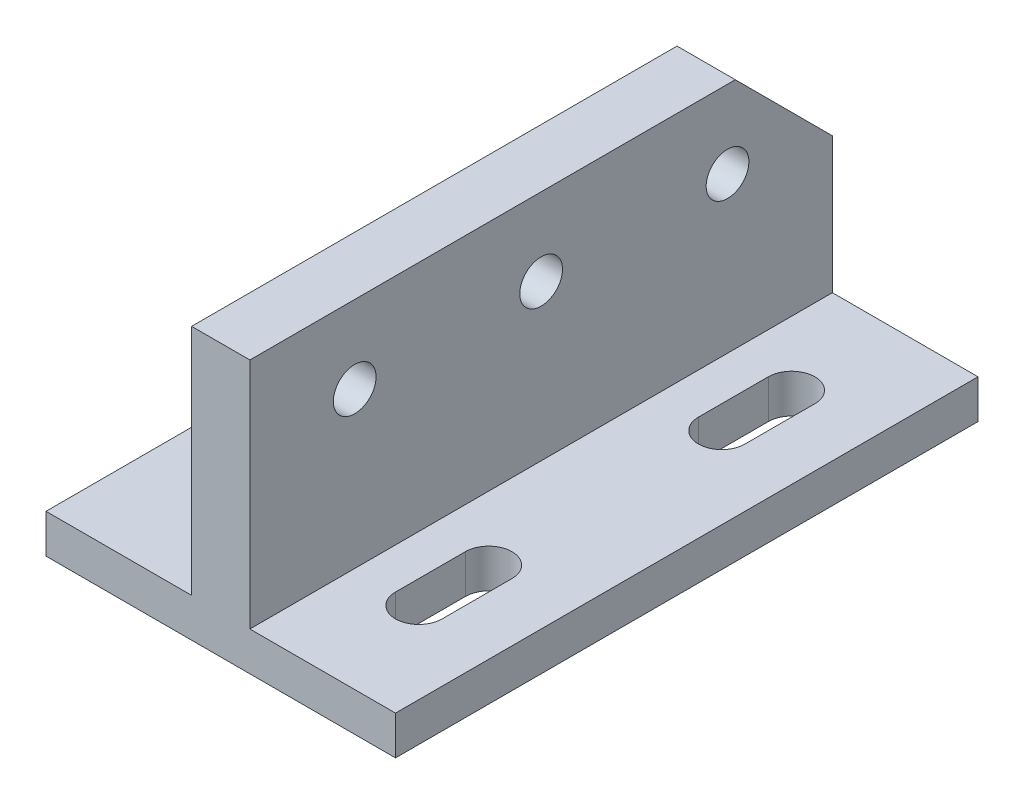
ISO-10303-21;
HEADER;
FILE_DESCRIPTION(('STEP AP214'),'2;1');
FILE_NAME('part.step','',(''),(''),'','','');
FILE_SCHEMA(('AUTOMOTIVE_DESIGN { 1 0 10303 214 1 1 1 1 }'));
ENDSEC;
DATA;
#1=APPLICATION_CONTEXT('core data for automotive mechanical design processes');
#2=APPLICATION_PROTOCOL_DEFINITION('international standard','automotive_design',2000,#1);
#3=PRODUCT_CONTEXT('',#1,'mechanical');
#4=PRODUCT('Part','Part','',(#3));
#5=PRODUCT_RELATED_PRODUCT_CATEGORY('part','',(#4));
#6=PRODUCT_DEFINITION_FORMATION('','',#4);
#7=PRODUCT_DEFINITION_CONTEXT('part definition',#1,'design');
#8=PRODUCT_DEFINITION('design','',#6,#7);
#9=PRODUCT_DEFINITION_SHAPE('','',#8);
#10=(LENGTH_UNIT() NAMED_UNIT(*) SI_UNIT(.MILLI.,.METRE.));
#11=(NAMED_UNIT(*) PLANE_ANGLE_UNIT() SI_UNIT($,.RADIAN.));
#12=(NAMED_UNIT(*) SI_UNIT($,.STERADIAN.) SOLID_ANGLE_UNIT());
#13=UNCERTAINTY_MEASURE_WITH_UNIT(LENGTH_MEASURE(1.E-05),#10,'distance_accuracy_value','');
#14=(GEOMETRIC_REPRESENTATION_CONTEXT(3) GLOBAL_UNCERTAINTY_ASSIGNED_CONTEXT((#13)) GLOBAL_UNIT_ASSIGNED_CONTEXT((#10,
#11,#12)) REPRESENTATION_CONTEXT('',''));
#15=CARTESIAN_POINT('',(0.,0.,0.));
#16=DIRECTION('',(0.,0.,1.));
#17=DIRECTION('',(1.,0.,0.));
#18=AXIS2_PLACEMENT_3D('',#15,#16,#17);
#19=CARTESIAN_POINT('',(-22.5,0.,-75.));
#20=DIRECTION('',(-1.,0.,0.));
#21=DIRECTION('',(0.,0.,1.));
#22=AXIS2_PLACEMENT_3D('',#19,#20,#21);
#23=PLANE('',#22);
#24=DIRECTION('',(0.,-1.,0.));
#25=VECTOR('',#24,1.);
#26=CARTESIAN_POINT('',(-22.5,0.,0.));
#27=LINE('',#26,#25);
#28=CARTESIAN_POINT('',(-22.5,5.,0.));
#29=VERTEX_POINT('',#28);
#30=CARTESIAN_POINT('',(-22.5,0.,0.));
#31=VERTEX_POINT('',#30);
#32=EDGE_CURVE('E362',#29,#31,#27,.T.);
#33=ORIENTED_EDGE('',*,*,#32,.F.);
#34=DIRECTION('',(0.,0.,1.));
#35=VECTOR('',#34,1.);
#36=CARTESIAN_POINT('',(-22.5,5.,-75.));
#37=LINE('',#36,#35);
#38=CARTESIAN_POINT('',(-22.5,5.,-75.));
#39=VERTEX_POINT('',#38);
#40=EDGE_CURVE('E338',#39,#29,#37,.T.);
#41=ORIENTED_EDGE('',*,*,#40,.F.);
#42=DIRECTION('',(0.,-1.,0.));
#43=VECTOR('',#42,1.);
#44=CARTESIAN_POINT('',(-22.5,0.,-75.));
#45=LINE('',#44,#43);
#46=CARTESIAN_POINT('',(-22.5,0.,-75.));
#47=VERTEX_POINT('',#46);
#48=EDGE_CURVE('E335',#39,#47,#45,.T.);
#49=ORIENTED_EDGE('',*,*,#48,.T.);
#50=DIRECTION('',(0.,0.,1.));
#51=VECTOR('',#50,1.);
#52=CARTESIAN_POINT('',(-22.5,0.,-75.));
#53=LINE('',#52,#51);
#54=EDGE_CURVE('E361',#47,#31,#53,.T.);
#55=ORIENTED_EDGE('',*,*,#54,.T.);
#56=EDGE_LOOP('',(#33,#41,#49,#55));
#57=FACE_BOUND('',#56,.T.);
#58=ADVANCED_FACE('F37',(#57),#23,.T.);
#59=CARTESIAN_POINT('',(-22.5,5.,-75.));
#60=DIRECTION('',(0.,1.,0.));
#61=DIRECTION('',(-1.,0.,0.));
#62=AXIS2_PLACEMENT_3D('',#59,#60,#61);
#63=PLANE('',#62);
#64=CARTESIAN_POINT('',(-12.,5.,-52.5));
#65=DIRECTION('',(0.,1.,0.));
#66=DIRECTION('',(-1.,0.,0.));
#67=AXIS2_PLACEMENT_3D('',#64,#65,#66);
#68=CIRCLE('',#67,3.);
#69=CARTESIAN_POINT('',(-15.,5.,-52.5));
#70=VERTEX_POINT('',#69);
#71=CARTESIAN_POINT('',(-8.99999999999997,5.,-52.5));
#72=VERTEX_POINT('',#71);
#73=EDGE_CURVE('E470',#70,#72,#68,.T.);
#74=ORIENTED_EDGE('',*,*,#73,.F.);
#75=DIRECTION('',(0.,0.,1.));
#76=VECTOR('',#75,1.);
#77=CARTESIAN_POINT('',(-15.,5.,-52.5));
#78=LINE('',#77,#76);
#79=CARTESIAN_POINT('',(-15.,5.,-61.5));
#80=VERTEX_POINT('',#79);
#81=EDGE_CURVE('E482',#80,#70,#78,.T.);
#82=ORIENTED_EDGE('',*,*,#81,.F.);
#83=CARTESIAN_POINT('',(-12.,5.,-61.5));
#84=DIRECTION('',(0.,1.,0.));
#85=DIRECTION('',(-1.,0.,0.));
#86=AXIS2_PLACEMENT_3D('',#83,#84,#85);
#87=CIRCLE('',#86,3.);
#88=CARTESIAN_POINT('',(-8.99999999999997,5.,-61.5));
#89=VERTEX_POINT('',#88);
#90=EDGE_CURVE('E486',#89,#80,#87,.T.);
#91=ORIENTED_EDGE('',*,*,#90,.F.);
#92=DIRECTION('',(0.,0.,-1.));
#93=VECTOR('',#92,1.);
#94=CARTESIAN_POINT('',(-8.99999999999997,5.,-52.5));
#95=LINE('',#94,#93);
#96=EDGE_CURVE('E489',#72,#89,#95,.T.);
#97=ORIENTED_EDGE('',*,*,#96,.F.);
#98=EDGE_LOOP('',(#74,#82,#91,#97));
#99=FACE_BOUND('',#98,.T.);
#100=CARTESIAN_POINT('',(-12.,5.,-22.5));
#101=DIRECTION('',(0.,1.,0.));
#102=DIRECTION('',(1.,0.,0.));
#103=AXIS2_PLACEMENT_3D('',#100,#101,#102);
#104=CIRCLE('',#103,3.);
#105=CARTESIAN_POINT('',(-9.,5.,-22.5));
#106=VERTEX_POINT('',#105);
#107=CARTESIAN_POINT('',(-15.,5.,-22.5));
#108=VERTEX_POINT('',#107);
#109=EDGE_CURVE('E210',#106,#108,#104,.T.);
#110=ORIENTED_EDGE('',*,*,#109,.F.);
#111=DIRECTION('',(0.,0.,-1.));
#112=VECTOR('',#111,1.);
#113=CARTESIAN_POINT('',(-9.,5.,-22.5));
#114=LINE('',#113,#112);
#115=CARTESIAN_POINT('',(-9.,5.,-13.5));
#116=VERTEX_POINT('',#115);
#117=EDGE_CURVE('E228',#116,#106,#114,.T.);
#118=ORIENTED_EDGE('',*,*,#117,.F.);
#119=CARTESIAN_POINT('',(-12.,5.,-13.5));
#120=DIRECTION('',(0.,1.,0.));
#121=DIRECTION('',(1.,0.,0.));
#122=AXIS2_PLACEMENT_3D('',#119,#120,#121);
#123=CIRCLE('',#122,3.);
#124=CARTESIAN_POINT('',(-15.,5.,-13.5));
#125=VERTEX_POINT('',#124);
#126=EDGE_CURVE('E231',#125,#116,#123,.T.);
#127=ORIENTED_EDGE('',*,*,#126,.F.);
#128=DIRECTION('',(0.,0.,1.));
#129=VECTOR('',#128,1.);
#130=CARTESIAN_POINT('',(-15.,5.,-22.5));
#131=LINE('',#130,#129);
#132=EDGE_CURVE('E497',#108,#125,#131,.T.);
#133=ORIENTED_EDGE('',*,*,#132,.F.);
#134=EDGE_LOOP('',(#110,#118,#127,#133));
#135=FACE_BOUND('',#134,.T.);
#136=DIRECTION('',(-1.,0.,0.));
#137=VECTOR('',#136,1.);
#138=CARTESIAN_POINT('',(-22.5,5.,0.));
#139=LINE('',#138,#137);
#140=CARTESIAN_POINT('',(-3.75,5.,0.));
#141=VERTEX_POINT('',#140);
#142=EDGE_CURVE('E332',#141,#29,#139,.T.);
#143=ORIENTED_EDGE('',*,*,#142,.F.);
#144=DIRECTION('',(0.,0.,1.));
#145=VECTOR('',#144,1.);
#146=CARTESIAN_POINT('',(-3.75,5.,-75.));
#147=LINE('',#146,#145);
#148=CARTESIAN_POINT('',(-3.75,5.,-75.));
#149=VERTEX_POINT('',#148);
#150=EDGE_CURVE('E342',#149,#141,#147,.T.);
#151=ORIENTED_EDGE('',*,*,#150,.F.);
#152=DIRECTION('',(-1.,0.,0.));
#153=VECTOR('',#152,1.);
#154=CARTESIAN_POINT('',(-22.5,5.,-75.));
#155=LINE('',#154,#153);
#156=EDGE_CURVE('E355',#149,#39,#155,.T.);
#157=ORIENTED_EDGE('',*,*,#156,.T.);
#158=ORIENTED_EDGE('',*,*,#40,.T.);
#159=EDGE_LOOP('',(#143,#151,#157,#158));
#160=FACE_BOUND('',#159,.T.);
#161=ADVANCED_FACE('F525',(#99,#135,#160),#63,.T.);
#162=CARTESIAN_POINT('',(-3.75,35.,-75.));
#163=DIRECTION('',(-1.,0.,0.));
#164=DIRECTION('',(0.,-1.,0.));
#165=AXIS2_PLACEMENT_3D('',#162,#163,#164);
#166=PLANE('',#165);
#167=CARTESIAN_POINT('',(-3.75,25.,-37.5));
#168=DIRECTION('',(-1.,0.,0.));
#169=DIRECTION('',(0.,-1.,0.));
#170=AXIS2_PLACEMENT_3D('',#167,#168,#169);
#171=CIRCLE('',#170,2.74999999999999);
#172=CARTESIAN_POINT('',(-3.75,22.25,-37.5));
#173=VERTEX_POINT('',#172);
#174=EDGE_CURVE('E289',#173,#173,#171,.T.);
#175=ORIENTED_EDGE('',*,*,#174,.F.);
#176=EDGE_LOOP('',(#175));
#177=FACE_BOUND('',#176,.T.);
#178=CARTESIAN_POINT('',(-3.75,25.,-13.5));
#179=DIRECTION('',(-1.,0.,0.));
#180=DIRECTION('',(0.,-1.,0.));
#181=AXIS2_PLACEMENT_3D('',#178,#179,#180);
#182=CIRCLE('',#181,2.74999999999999);
#183=CARTESIAN_POINT('',(-3.75,22.25,-13.5));
#184=VERTEX_POINT('',#183);
#185=EDGE_CURVE('E299',#184,#184,#182,.T.);
#186=ORIENTED_EDGE('',*,*,#185,.F.);
#187=EDGE_LOOP('',(#186));
#188=FACE_BOUND('',#187,.T.);
#189=CARTESIAN_POINT('',(-3.75,25.,-61.5));
#190=DIRECTION('',(-1.,0.,0.));
#191=DIRECTION('',(0.,-1.,0.));
#192=AXIS2_PLACEMENT_3D('',#189,#190,#191);
#193=CIRCLE('',#192,2.74999999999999);
#194=CARTESIAN_POINT('',(-3.75,22.25,-61.5));
#195=VERTEX_POINT('',#194);
#196=EDGE_CURVE('E235',#195,#195,#193,.T.);
#197=ORIENTED_EDGE('',*,*,#196,.F.);
#198=EDGE_LOOP('',(#197));
#199=FACE_BOUND('',#198,.T.);
#200=DIRECTION('',(0.,0.,1.));
#201=VECTOR('',#200,1.);
#202=CARTESIAN_POINT('',(-3.75,35.,-75.));
#203=LINE('',#202,#201);
#204=CARTESIAN_POINT('',(-3.75,35.,-62.5));
#205=VERTEX_POINT('',#204);
#206=CARTESIAN_POINT('',(-3.75,35.,0.));
#207=VERTEX_POINT('',#206);
#208=EDGE_CURVE('E345',#205,#207,#203,.T.);
#209=ORIENTED_EDGE('',*,*,#208,.F.);
#210=DIRECTION('',(0.,0.707106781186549,0.707106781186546));
#211=VECTOR('',#210,1.);
#212=CARTESIAN_POINT('',(-3.75,28.75,-68.75));
#213=LINE('',#212,#211);
#214=CARTESIAN_POINT('',(-3.75,22.5,-75.));
#215=VERTEX_POINT('',#214);
#216=EDGE_CURVE('E59',#205,#215,#213,.F.);
#217=ORIENTED_EDGE('',*,*,#216,.T.);
#218=DIRECTION('',(0.,-1.,0.));
#219=VECTOR('',#218,1.);
#220=CARTESIAN_POINT('',(-3.75,35.,-75.));
#221=LINE('',#220,#219);
#222=EDGE_CURVE('E351',#215,#149,#221,.T.);
#223=ORIENTED_EDGE('',*,*,#222,.T.);
#224=ORIENTED_EDGE('',*,*,#150,.T.);
#225=DIRECTION('',(0.,-1.,0.));
#226=VECTOR('',#225,1.);
#227=CARTESIAN_POINT('',(-3.75,35.,0.));
#228=LINE('',#227,#226);
#229=EDGE_CURVE('E336',#207,#141,#228,.T.);
#230=ORIENTED_EDGE('',*,*,#229,.F.);
#231=EDGE_LOOP('',(#209,#217,#223,#224,#230));
#232=FACE_BOUND('',#231,.T.);
#233=ADVANCED_FACE('F528',(#177,#188,#199,#232),#166,.T.);
#234=CARTESIAN_POINT('',(-3.75,35.,-75.));
#235=DIRECTION('',(0.,1.,0.));
#236=DIRECTION('',(0.,0.,1.));
#237=AXIS2_PLACEMENT_3D('',#234,#235,#236);
#238=PLANE('',#237);
#239=DIRECTION('',(0.,0.,1.));
#240=VECTOR('',#239,1.);
#241=CARTESIAN_POINT('',(3.75,35.,-75.));
#242=LINE('',#241,#240);
#243=CARTESIAN_POINT('',(3.75,35.,-62.5));
#244=VERTEX_POINT('',#243);
#245=CARTESIAN_POINT('',(3.75,35.,0.));
#246=VERTEX_POINT('',#245);
#247=EDGE_CURVE('E588',#244,#246,#242,.T.);
#248=ORIENTED_EDGE('',*,*,#247,.F.);
#249=DIRECTION('',(-1.,0.,0.));
#250=VECTOR('',#249,1.);
#251=CARTESIAN_POINT('',(-3.75,35.,-62.5));
#252=LINE('',#251,#250);
#253=EDGE_CURVE('E341',#244,#205,#252,.T.);
#254=ORIENTED_EDGE('',*,*,#253,.T.);
#255=ORIENTED_EDGE('',*,*,#208,.T.);
#256=DIRECTION('',(-1.,0.,0.));
#257=VECTOR('',#256,1.);
#258=CARTESIAN_POINT('',(-3.75,35.,0.));
#259=LINE('',#258,#257);
#260=EDGE_CURVE('E544',#246,#207,#259,.T.);
#261=ORIENTED_EDGE('',*,*,#260,.F.);
#262=EDGE_LOOP('',(#248,#254,#255,#261));
#263=FACE_BOUND('',#262,.T.);
#264=ADVANCED_FACE('F587',(#263),#238,.T.);
#265=CARTESIAN_POINT('',(3.75,35.,-75.));
#266=DIRECTION('',(1.,0.,0.));
#267=DIRECTION('',(0.,1.,0.));
#268=AXIS2_PLACEMENT_3D('',#265,#266,#267);
#269=PLANE('',#268);
#270=CARTESIAN_POINT('',(3.75,25.,-37.5));
#271=DIRECTION('',(1.,0.,0.));
#272=DIRECTION('',(0.,0.,-1.));
#273=AXIS2_PLACEMENT_3D('',#270,#271,#272);
#274=CIRCLE('',#273,2.74999999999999);
#275=CARTESIAN_POINT('',(3.75,25.,-40.25));
#276=VERTEX_POINT('',#275);
#277=EDGE_CURVE('E295',#276,#276,#274,.T.);
#278=ORIENTED_EDGE('',*,*,#277,.F.);
#279=EDGE_LOOP('',(#278));
#280=FACE_BOUND('',#279,.T.);
#281=CARTESIAN_POINT('',(3.75,25.,-13.5));
#282=DIRECTION('',(1.,0.,0.));
#283=DIRECTION('',(0.,0.,-1.));
#284=AXIS2_PLACEMENT_3D('',#281,#282,#283);
#285=CIRCLE('',#284,2.74999999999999);
#286=CARTESIAN_POINT('',(3.75,25.,-16.25));
#287=VERTEX_POINT('',#286);
#288=EDGE_CURVE('E294',#287,#287,#285,.T.);
#289=ORIENTED_EDGE('',*,*,#288,.F.);
#290=EDGE_LOOP('',(#289));
#291=FACE_BOUND('',#290,.T.);
#292=CARTESIAN_POINT('',(3.75,25.,-61.5));
#293=DIRECTION('',(1.,0.,0.));
#294=DIRECTION('',(0.,0.,-1.));
#295=AXIS2_PLACEMENT_3D('',#292,#293,#294);
#296=CIRCLE('',#295,2.74999999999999);
#297=CARTESIAN_POINT('',(3.75,25.,-64.25));
#298=VERTEX_POINT('',#297);
#299=EDGE_CURVE('E592',#298,#298,#296,.T.);
#300=ORIENTED_EDGE('',*,*,#299,.F.);
#301=EDGE_LOOP('',(#300));
#302=FACE_BOUND('',#301,.T.);
#303=DIRECTION('',(0.,1.,0.));
#304=VECTOR('',#303,1.);
#305=CARTESIAN_POINT('',(3.75,35.,-75.));
#306=LINE('',#305,#304);
#307=CARTESIAN_POINT('',(3.75,5.,-75.));
#308=VERTEX_POINT('',#307);
#309=CARTESIAN_POINT('',(3.75,22.5,-75.));
#310=VERTEX_POINT('',#309);
#311=EDGE_CURVE('E356',#308,#310,#306,.T.);
#312=ORIENTED_EDGE('',*,*,#311,.T.);
#313=DIRECTION('',(0.,-0.707106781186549,-0.707106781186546));
#314=VECTOR('',#313,1.);
#315=CARTESIAN_POINT('',(3.75,28.75,-68.75));
#316=LINE('',#315,#314);
#317=EDGE_CURVE('E12',#310,#244,#316,.F.);
#318=ORIENTED_EDGE('',*,*,#317,.T.);
#319=ORIENTED_EDGE('',*,*,#247,.T.);
#320=DIRECTION('',(0.,1.,0.));
#321=VECTOR('',#320,1.);
#322=CARTESIAN_POINT('',(3.75,35.,0.));
#323=LINE('',#322,#321);
#324=CARTESIAN_POINT('',(3.75,5.,0.));
#325=VERTEX_POINT('',#324);
#326=EDGE_CURVE('E322',#325,#246,#323,.T.);
#327=ORIENTED_EDGE('',*,*,#326,.F.);
#328=DIRECTION('',(0.,0.,1.));
#329=VECTOR('',#328,1.);
#330=CARTESIAN_POINT('',(3.75,5.,-75.));
#331=LINE('',#330,#329);
#332=EDGE_CURVE('E562',#308,#325,#331,.T.);
#333=ORIENTED_EDGE('',*,*,#332,.F.);
#334=EDGE_LOOP('',(#312,#318,#319,#327,#333));
#335=FACE_BOUND('',#334,.T.);
#336=ADVANCED_FACE('F581',(#280,#291,#302,#335),#269,.T.);
#337=CARTESIAN_POINT('',(3.75,5.,-75.));
#338=DIRECTION('',(0.,1.,0.));
#339=DIRECTION('',(-1.,0.,0.));
#340=AXIS2_PLACEMENT_3D('',#337,#338,#339);
#341=PLANE('',#340);
#342=CARTESIAN_POINT('',(12.,5.,-52.5));
#343=DIRECTION('',(0.,1.,0.));
#344=DIRECTION('',(1.,0.,0.));
#345=AXIS2_PLACEMENT_3D('',#342,#343,#344);
#346=CIRCLE('',#345,3.);
#347=CARTESIAN_POINT('',(9.,5.,-52.5));
#348=VERTEX_POINT('',#347);
#349=CARTESIAN_POINT('',(15.,5.,-52.5));
#350=VERTEX_POINT('',#349);
#351=EDGE_CURVE('E255',#348,#350,#346,.T.);
#352=ORIENTED_EDGE('',*,*,#351,.F.);
#353=DIRECTION('',(0.,0.,1.));
#354=VECTOR('',#353,1.);
#355=CARTESIAN_POINT('',(9.,5.,-52.5));
#356=LINE('',#355,#354);
#357=CARTESIAN_POINT('',(9.00000000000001,5.,-61.5));
#358=VERTEX_POINT('',#357);
#359=EDGE_CURVE('E261',#358,#348,#356,.T.);
#360=ORIENTED_EDGE('',*,*,#359,.F.);
#361=CARTESIAN_POINT('',(12.,5.,-61.5));
#362=DIRECTION('',(0.,1.,0.));
#363=DIRECTION('',(1.,0.,0.));
#364=AXIS2_PLACEMENT_3D('',#361,#362,#363);
#365=CIRCLE('',#364,3.);
#366=CARTESIAN_POINT('',(15.,5.,-61.5));
#367=VERTEX_POINT('',#366);
#368=EDGE_CURVE('E254',#367,#358,#365,.T.);
#369=ORIENTED_EDGE('',*,*,#368,.F.);
#370=DIRECTION('',(0.,0.,-1.));
#371=VECTOR('',#370,1.);
#372=CARTESIAN_POINT('',(15.,5.,-52.5));
#373=LINE('',#372,#371);
#374=EDGE_CURVE('E249',#350,#367,#373,.T.);
#375=ORIENTED_EDGE('',*,*,#374,.F.);
#376=EDGE_LOOP('',(#352,#360,#369,#375));
#377=FACE_BOUND('',#376,.T.);
#378=CARTESIAN_POINT('',(12.,5.,-22.5));
#379=DIRECTION('',(0.,1.,0.));
#380=DIRECTION('',(-1.,0.,0.));
#381=AXIS2_PLACEMENT_3D('',#378,#379,#380);
#382=CIRCLE('',#381,3.);
#383=CARTESIAN_POINT('',(15.,5.,-22.5));
#384=VERTEX_POINT('',#383);
#385=CARTESIAN_POINT('',(9.,5.,-22.5));
#386=VERTEX_POINT('',#385);
#387=EDGE_CURVE('E379',#384,#386,#382,.T.);
#388=ORIENTED_EDGE('',*,*,#387,.F.);
#389=DIRECTION('',(0.,0.,-1.));
#390=VECTOR('',#389,1.);
#391=CARTESIAN_POINT('',(15.,5.,-22.5));
#392=LINE('',#391,#390);
#393=CARTESIAN_POINT('',(15.,5.,-13.5));
#394=VERTEX_POINT('',#393);
#395=EDGE_CURVE('E385',#394,#384,#392,.T.);
#396=ORIENTED_EDGE('',*,*,#395,.F.);
#397=CARTESIAN_POINT('',(12.,5.,-13.5));
#398=DIRECTION('',(0.,1.,0.));
#399=DIRECTION('',(-1.,0.,0.));
#400=AXIS2_PLACEMENT_3D('',#397,#398,#399);
#401=CIRCLE('',#400,3.);
#402=CARTESIAN_POINT('',(9.,5.,-13.5));
#403=VERTEX_POINT('',#402);
#404=EDGE_CURVE('E378',#403,#394,#401,.T.);
#405=ORIENTED_EDGE('',*,*,#404,.F.);
#406=DIRECTION('',(0.,0.,1.));
#407=VECTOR('',#406,1.);
#408=CARTESIAN_POINT('',(9.,5.,-22.5));
#409=LINE('',#408,#407);
#410=EDGE_CURVE('E373',#386,#403,#409,.T.);
#411=ORIENTED_EDGE('',*,*,#410,.F.);
#412=EDGE_LOOP('',(#388,#396,#405,#411));
#413=FACE_BOUND('',#412,.T.);
#414=DIRECTION('',(-1.,0.,0.));
#415=VECTOR('',#414,1.);
#416=CARTESIAN_POINT('',(3.75,5.,0.));
#417=LINE('',#416,#415);
#418=CARTESIAN_POINT('',(22.5,5.00000000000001,0.));
#419=VERTEX_POINT('',#418);
#420=EDGE_CURVE('E315',#419,#325,#417,.T.);
#421=ORIENTED_EDGE('',*,*,#420,.F.);
#422=DIRECTION('',(0.,0.,1.));
#423=VECTOR('',#422,1.);
#424=CARTESIAN_POINT('',(22.5,5.00000000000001,-75.));
#425=LINE('',#424,#423);
#426=CARTESIAN_POINT('',(22.5,5.00000000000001,-75.));
#427=VERTEX_POINT('',#426);
#428=EDGE_CURVE('E560',#427,#419,#425,.T.);
#429=ORIENTED_EDGE('',*,*,#428,.F.);
#430=DIRECTION('',(-1.,0.,0.));
#431=VECTOR('',#430,1.);
#432=CARTESIAN_POINT('',(3.75,5.,-75.));
#433=LINE('',#432,#431);
#434=EDGE_CURVE('E572',#427,#308,#433,.T.);
#435=ORIENTED_EDGE('',*,*,#434,.T.);
#436=ORIENTED_EDGE('',*,*,#332,.T.);
#437=EDGE_LOOP('',(#421,#429,#435,#436));
#438=FACE_BOUND('',#437,.T.);
#439=ADVANCED_FACE('F636',(#377,#413,#438),#341,.T.);
#440=CARTESIAN_POINT('',(22.5,0.,-75.));
#441=DIRECTION('',(1.,0.,0.));
#442=DIRECTION('',(0.,0.,-1.));
#443=AXIS2_PLACEMENT_3D('',#440,#441,#442);
#444=PLANE('',#443);
#445=DIRECTION('',(0.,1.,0.));
#446=VECTOR('',#445,1.);
#447=CARTESIAN_POINT('',(22.5,0.,0.));
#448=LINE('',#447,#446);
#449=CARTESIAN_POINT('',(22.5,0.,0.));
#450=VERTEX_POINT('',#449);
#451=EDGE_CURVE('E310',#450,#419,#448,.T.);
#452=ORIENTED_EDGE('',*,*,#451,.F.);
#453=DIRECTION('',(0.,0.,1.));
#454=VECTOR('',#453,1.);
#455=CARTESIAN_POINT('',(22.5,0.,-75.));
#456=LINE('',#455,#454);
#457=CARTESIAN_POINT('',(22.5,0.,-75.));
#458=VERTEX_POINT('',#457);
#459=EDGE_CURVE('E557',#458,#450,#456,.T.);
#460=ORIENTED_EDGE('',*,*,#459,.F.);
#461=DIRECTION('',(0.,1.,0.));
#462=VECTOR('',#461,1.);
#463=CARTESIAN_POINT('',(22.5,0.,-75.));
#464=LINE('',#463,#462);
#465=EDGE_CURVE('E569',#458,#427,#464,.T.);
#466=ORIENTED_EDGE('',*,*,#465,.T.);
#467=ORIENTED_EDGE('',*,*,#428,.T.);
#468=EDGE_LOOP('',(#452,#460,#466,#467));
#469=FACE_BOUND('',#468,.T.);
#470=ADVANCED_FACE('F632',(#469),#444,.T.);
#471=CARTESIAN_POINT('',(-22.5,0.,-75.));
#472=DIRECTION('',(0.,-1.,0.));
#473=DIRECTION('',(1.,0.,0.));
#474=AXIS2_PLACEMENT_3D('',#471,#472,#473);
#475=PLANE('',#474);
#476=CARTESIAN_POINT('',(12.,0.,-52.5));
#477=DIRECTION('',(0.,1.,0.));
#478=DIRECTION('',(1.,0.,0.));
#479=AXIS2_PLACEMENT_3D('',#476,#477,#478);
#480=CIRCLE('',#479,3.);
#481=CARTESIAN_POINT('',(9.00000000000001,0.,-52.5));
#482=VERTEX_POINT('',#481);
#483=CARTESIAN_POINT('',(15.,0.,-52.5));
#484=VERTEX_POINT('',#483);
#485=EDGE_CURVE('E440',#482,#484,#480,.T.);
#486=ORIENTED_EDGE('',*,*,#485,.T.);
#487=DIRECTION('',(0.,0.,-1.));
#488=VECTOR('',#487,1.);
#489=CARTESIAN_POINT('',(15.,0.,-52.5));
#490=LINE('',#489,#488);
#491=CARTESIAN_POINT('',(15.,0.,-61.5));
#492=VERTEX_POINT('',#491);
#493=EDGE_CURVE('E436',#484,#492,#490,.T.);
#494=ORIENTED_EDGE('',*,*,#493,.T.);
#495=CARTESIAN_POINT('',(12.,0.,-61.5));
#496=DIRECTION('',(0.,1.,0.));
#497=DIRECTION('',(1.,0.,0.));
#498=AXIS2_PLACEMENT_3D('',#495,#496,#497);
#499=CIRCLE('',#498,3.);
#500=CARTESIAN_POINT('',(9.00000000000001,0.,-61.5));
#501=VERTEX_POINT('',#500);
#502=EDGE_CURVE('E433',#492,#501,#499,.T.);
#503=ORIENTED_EDGE('',*,*,#502,.T.);
#504=DIRECTION('',(0.,0.,1.));
#505=VECTOR('',#504,1.);
#506=CARTESIAN_POINT('',(9.00000000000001,0.,-52.5));
#507=LINE('',#506,#505);
#508=EDGE_CURVE('E430',#501,#482,#507,.T.);
#509=ORIENTED_EDGE('',*,*,#508,.T.);
#510=EDGE_LOOP('',(#486,#494,#503,#509));
#511=FACE_BOUND('',#510,.T.);
#512=CARTESIAN_POINT('',(-12.,0.,-52.5));
#513=DIRECTION('',(0.,1.,0.));
#514=DIRECTION('',(-1.,0.,0.));
#515=AXIS2_PLACEMENT_3D('',#512,#513,#514);
#516=CIRCLE('',#515,3.);
#517=CARTESIAN_POINT('',(-15.,0.,-52.5));
#518=VERTEX_POINT('',#517);
#519=CARTESIAN_POINT('',(-8.99999999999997,0.,-52.5));
#520=VERTEX_POINT('',#519);
#521=EDGE_CURVE('E462',#518,#520,#516,.T.);
#522=ORIENTED_EDGE('',*,*,#521,.T.);
#523=DIRECTION('',(0.,0.,-1.));
#524=VECTOR('',#523,1.);
#525=CARTESIAN_POINT('',(-8.99999999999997,0.,-52.5));
#526=LINE('',#525,#524);
#527=CARTESIAN_POINT('',(-8.99999999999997,0.,-61.5));
#528=VERTEX_POINT('',#527);
#529=EDGE_CURVE('E458',#520,#528,#526,.T.);
#530=ORIENTED_EDGE('',*,*,#529,.T.);
#531=CARTESIAN_POINT('',(-12.,0.,-61.5));
#532=DIRECTION('',(0.,1.,0.));
#533=DIRECTION('',(-1.,0.,0.));
#534=AXIS2_PLACEMENT_3D('',#531,#532,#533);
#535=CIRCLE('',#534,3.);
#536=CARTESIAN_POINT('',(-15.,0.,-61.5));
#537=VERTEX_POINT('',#536);
#538=EDGE_CURVE('E461',#528,#537,#535,.T.);
#539=ORIENTED_EDGE('',*,*,#538,.T.);
#540=DIRECTION('',(0.,0.,1.));
#541=VECTOR('',#540,1.);
#542=CARTESIAN_POINT('',(-15.,0.,-52.5));
#543=LINE('',#542,#541);
#544=EDGE_CURVE('E450',#537,#518,#543,.T.);
#545=ORIENTED_EDGE('',*,*,#544,.T.);
#546=EDGE_LOOP('',(#522,#530,#539,#545));
#547=FACE_BOUND('',#546,.T.);
#548=CARTESIAN_POINT('',(-12.,0.,-22.5));
#549=DIRECTION('',(0.,1.,0.));
#550=DIRECTION('',(1.,0.,0.));
#551=AXIS2_PLACEMENT_3D('',#548,#549,#550);
#552=CIRCLE('',#551,3.);
#553=CARTESIAN_POINT('',(-8.99999999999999,0.,-22.5));
#554=VERTEX_POINT('',#553);
#555=CARTESIAN_POINT('',(-15.,0.,-22.5));
#556=VERTEX_POINT('',#555);
#557=EDGE_CURVE('E207',#554,#556,#552,.T.);
#558=ORIENTED_EDGE('',*,*,#557,.T.);
#559=DIRECTION('',(0.,0.,1.));
#560=VECTOR('',#559,1.);
#561=CARTESIAN_POINT('',(-15.,0.,-22.5));
#562=LINE('',#561,#560);
#563=CARTESIAN_POINT('',(-15.,0.,-13.5));
#564=VERTEX_POINT('',#563);
#565=EDGE_CURVE('E219',#556,#564,#562,.T.);
#566=ORIENTED_EDGE('',*,*,#565,.T.);
#567=CARTESIAN_POINT('',(-12.,0.,-13.5));
#568=DIRECTION('',(0.,1.,0.));
#569=DIRECTION('',(1.,0.,0.));
#570=AXIS2_PLACEMENT_3D('',#567,#568,#569);
#571=CIRCLE('',#570,3.);
#572=CARTESIAN_POINT('',(-9.,0.,-13.5));
#573=VERTEX_POINT('',#572);
#574=EDGE_CURVE('E223',#564,#573,#571,.T.);
#575=ORIENTED_EDGE('',*,*,#574,.T.);
#576=DIRECTION('',(0.,0.,-1.));
#577=VECTOR('',#576,1.);
#578=CARTESIAN_POINT('',(-8.99999999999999,0.,-22.5));
#579=LINE('',#578,#577);
#580=EDGE_CURVE('E215',#573,#554,#579,.T.);
#581=ORIENTED_EDGE('',*,*,#580,.T.);
#582=EDGE_LOOP('',(#558,#566,#575,#581));
#583=FACE_BOUND('',#582,.T.);
#584=CARTESIAN_POINT('',(12.,0.,-22.5));
#585=DIRECTION('',(0.,1.,0.));
#586=DIRECTION('',(-1.,0.,0.));
#587=AXIS2_PLACEMENT_3D('',#584,#585,#586);
#588=CIRCLE('',#587,3.);
#589=CARTESIAN_POINT('',(15.,0.,-22.5));
#590=VERTEX_POINT('',#589);
#591=CARTESIAN_POINT('',(9.,0.,-22.5));
#592=VERTEX_POINT('',#591);
#593=EDGE_CURVE('E923',#590,#592,#588,.T.);
#594=ORIENTED_EDGE('',*,*,#593,.T.);
#595=DIRECTION('',(0.,0.,1.));
#596=VECTOR('',#595,1.);
#597=CARTESIAN_POINT('',(9.,0.,-22.5));
#598=LINE('',#597,#596);
#599=CARTESIAN_POINT('',(9.,0.,-13.5));
#600=VERTEX_POINT('',#599);
#601=EDGE_CURVE('E400',#592,#600,#598,.T.);
#602=ORIENTED_EDGE('',*,*,#601,.T.);
#603=CARTESIAN_POINT('',(12.,0.,-13.5));
#604=DIRECTION('',(0.,1.,0.));
#605=DIRECTION('',(-1.,0.,0.));
#606=AXIS2_PLACEMENT_3D('',#603,#604,#605);
#607=CIRCLE('',#606,3.);
#608=CARTESIAN_POINT('',(15.,0.,-13.5));
#609=VERTEX_POINT('',#608);
#610=EDGE_CURVE('E395',#600,#609,#607,.T.);
#611=ORIENTED_EDGE('',*,*,#610,.T.);
#612=DIRECTION('',(0.,0.,-1.));
#613=VECTOR('',#612,1.);
#614=CARTESIAN_POINT('',(15.,0.,-22.5));
#615=LINE('',#614,#613);
#616=EDGE_CURVE('E399',#609,#590,#615,.T.);
#617=ORIENTED_EDGE('',*,*,#616,.T.);
#618=EDGE_LOOP('',(#594,#602,#611,#617));
#619=FACE_BOUND('',#618,.T.);
#620=DIRECTION('',(1.,0.,0.));
#621=VECTOR('',#620,1.);
#622=CARTESIAN_POINT('',(-22.5,0.,0.));
#623=LINE('',#622,#621);
#624=EDGE_CURVE('E316',#31,#450,#623,.T.);
#625=ORIENTED_EDGE('',*,*,#624,.F.);
#626=ORIENTED_EDGE('',*,*,#54,.F.);
#627=DIRECTION('',(1.,0.,0.));
#628=VECTOR('',#627,1.);
#629=CARTESIAN_POINT('',(-22.5,0.,-75.));
#630=LINE('',#629,#628);
#631=EDGE_CURVE('E573',#47,#458,#630,.T.);
#632=ORIENTED_EDGE('',*,*,#631,.T.);
#633=ORIENTED_EDGE('',*,*,#459,.T.);
#634=EDGE_LOOP('',(#625,#626,#632,#633));
#635=FACE_BOUND('',#634,.T.);
#636=ADVANCED_FACE('F225',(#511,#547,#583,#619,#635),#475,.T.);
#637=CARTESIAN_POINT('',(0.,0.,-75.));
#638=DIRECTION('',(0.,0.,-1.));
#639=DIRECTION('',(-1.,0.,0.));
#640=AXIS2_PLACEMENT_3D('',#637,#638,#639);
#641=PLANE('',#640);
#642=ORIENTED_EDGE('',*,*,#222,.F.);
#643=DIRECTION('',(1.,0.,0.));
#644=VECTOR('',#643,1.);
#645=CARTESIAN_POINT('',(0.,22.5,-75.));
#646=LINE('',#645,#644);
#647=EDGE_CURVE('E45',#215,#310,#646,.T.);
#648=ORIENTED_EDGE('',*,*,#647,.T.);
#649=ORIENTED_EDGE('',*,*,#311,.F.);
#650=ORIENTED_EDGE('',*,*,#434,.F.);
#651=ORIENTED_EDGE('',*,*,#465,.F.);
#652=ORIENTED_EDGE('',*,*,#631,.F.);
#653=ORIENTED_EDGE('',*,*,#48,.F.);
#654=ORIENTED_EDGE('',*,*,#156,.F.);
#655=EDGE_LOOP('',(#642,#648,#649,#650,#651,#652,#653,#654));
#656=FACE_BOUND('',#655,.T.);
#657=ADVANCED_FACE('F631',(#656),#641,.T.);
#658=CARTESIAN_POINT('',(0.,0.,0.));
#659=DIRECTION('',(0.,0.,-1.));
#660=DIRECTION('',(-1.,0.,0.));
#661=AXIS2_PLACEMENT_3D('',#658,#659,#660);
#662=PLANE('',#661);
#663=ORIENTED_EDGE('',*,*,#32,.T.);
#664=ORIENTED_EDGE('',*,*,#624,.T.);
#665=ORIENTED_EDGE('',*,*,#451,.T.);
#666=ORIENTED_EDGE('',*,*,#420,.T.);
#667=ORIENTED_EDGE('',*,*,#326,.T.);
#668=ORIENTED_EDGE('',*,*,#260,.T.);
#669=ORIENTED_EDGE('',*,*,#229,.T.);
#670=ORIENTED_EDGE('',*,*,#142,.T.);
#671=EDGE_LOOP('',(#663,#664,#665,#666,#667,#668,#669,#670));
#672=FACE_BOUND('',#671,.T.);
#673=ADVANCED_FACE('F538',(#672),#662,.F.);
#674=CARTESIAN_POINT('',(12.,0.,-22.5));
#675=DIRECTION('',(0.,1.,0.));
#676=DIRECTION('',(-1.,0.,0.));
#677=AXIS2_PLACEMENT_3D('',#674,#675,#676);
#678=CYLINDRICAL_SURFACE('',#677,3.);
#679=ORIENTED_EDGE('',*,*,#387,.T.);
#680=DIRECTION('',(0.,1.,0.));
#681=VECTOR('',#680,1.);
#682=CARTESIAN_POINT('',(9.,0.,-22.5));
#683=LINE('',#682,#681);
#684=EDGE_CURVE('E404',#592,#386,#683,.T.);
#685=ORIENTED_EDGE('',*,*,#684,.F.);
#686=ORIENTED_EDGE('',*,*,#593,.F.);
#687=DIRECTION('',(0.,1.,0.));
#688=VECTOR('',#687,1.);
#689=CARTESIAN_POINT('',(15.,0.,-22.5));
#690=LINE('',#689,#688);
#691=EDGE_CURVE('E414',#590,#384,#690,.T.);
#692=ORIENTED_EDGE('',*,*,#691,.T.);
#693=EDGE_LOOP('',(#679,#685,#686,#692));
#694=FACE_BOUND('',#693,.T.);
#695=ADVANCED_FACE('F648',(#694),#678,.F.);
#696=CARTESIAN_POINT('',(15.,0.,-22.5));
#697=DIRECTION('',(1.,0.,0.));
#698=DIRECTION('',(0.,1.,0.));
#699=AXIS2_PLACEMENT_3D('',#696,#697,#698);
#700=PLANE('',#699);
#701=ORIENTED_EDGE('',*,*,#395,.T.);
#702=ORIENTED_EDGE('',*,*,#691,.F.);
#703=ORIENTED_EDGE('',*,*,#616,.F.);
#704=DIRECTION('',(0.,1.,0.));
#705=VECTOR('',#704,1.);
#706=CARTESIAN_POINT('',(15.,0.,-13.5));
#707=LINE('',#706,#705);
#708=EDGE_CURVE('E412',#609,#394,#707,.T.);
#709=ORIENTED_EDGE('',*,*,#708,.T.);
#710=EDGE_LOOP('',(#701,#702,#703,#709));
#711=FACE_BOUND('',#710,.T.);
#712=ADVANCED_FACE('F653',(#711),#700,.F.);
#713=CARTESIAN_POINT('',(12.,0.,-13.5));
#714=DIRECTION('',(0.,1.,0.));
#715=DIRECTION('',(-1.,0.,0.));
#716=AXIS2_PLACEMENT_3D('',#713,#714,#715);
#717=CYLINDRICAL_SURFACE('',#716,3.);
#718=ORIENTED_EDGE('',*,*,#404,.T.);
#719=ORIENTED_EDGE('',*,*,#708,.F.);
#720=ORIENTED_EDGE('',*,*,#610,.F.);
#721=DIRECTION('',(0.,1.,0.));
#722=VECTOR('',#721,1.);
#723=CARTESIAN_POINT('',(9.,0.,-13.5));
#724=LINE('',#723,#722);
#725=EDGE_CURVE('E415',#600,#403,#724,.T.);
#726=ORIENTED_EDGE('',*,*,#725,.T.);
#727=EDGE_LOOP('',(#718,#719,#720,#726));
#728=FACE_BOUND('',#727,.T.);
#729=ADVANCED_FACE('F658',(#728),#717,.F.);
#730=CARTESIAN_POINT('',(9.,0.,-22.5));
#731=DIRECTION('',(-1.,0.,0.));
#732=DIRECTION('',(0.,-1.,0.));
#733=AXIS2_PLACEMENT_3D('',#730,#731,#732);
#734=PLANE('',#733);
#735=ORIENTED_EDGE('',*,*,#410,.T.);
#736=ORIENTED_EDGE('',*,*,#725,.F.);
#737=ORIENTED_EDGE('',*,*,#601,.F.);
#738=ORIENTED_EDGE('',*,*,#684,.T.);
#739=EDGE_LOOP('',(#735,#736,#737,#738));
#740=FACE_BOUND('',#739,.T.);
#741=ADVANCED_FACE('F655',(#740),#734,.F.);
#742=CARTESIAN_POINT('',(-12.,0.,-22.5));
#743=DIRECTION('',(0.,1.,0.));
#744=DIRECTION('',(-1.,0.,0.));
#745=AXIS2_PLACEMENT_3D('',#742,#743,#744);
#746=CYLINDRICAL_SURFACE('',#745,3.);
#747=ORIENTED_EDGE('',*,*,#109,.T.);
#748=DIRECTION('',(0.,1.,0.));
#749=VECTOR('',#748,1.);
#750=CARTESIAN_POINT('',(-15.,0.,-22.5));
#751=LINE('',#750,#749);
#752=EDGE_CURVE('E203',#556,#108,#751,.T.);
#753=ORIENTED_EDGE('',*,*,#752,.F.);
#754=ORIENTED_EDGE('',*,*,#557,.F.);
#755=DIRECTION('',(0.,1.,0.));
#756=VECTOR('',#755,1.);
#757=CARTESIAN_POINT('',(-8.99999999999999,0.,-22.5));
#758=LINE('',#757,#756);
#759=EDGE_CURVE('E515',#554,#106,#758,.T.);
#760=ORIENTED_EDGE('',*,*,#759,.T.);
#761=EDGE_LOOP('',(#747,#753,#754,#760));
#762=FACE_BOUND('',#761,.T.);
#763=ADVANCED_FACE('F205',(#762),#746,.F.);
#764=CARTESIAN_POINT('',(-8.99999999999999,0.,-22.5));
#765=DIRECTION('',(1.,0.,0.));
#766=DIRECTION('',(0.,1.,0.));
#767=AXIS2_PLACEMENT_3D('',#764,#765,#766);
#768=PLANE('',#767);
#769=ORIENTED_EDGE('',*,*,#117,.T.);
#770=ORIENTED_EDGE('',*,*,#759,.F.);
#771=ORIENTED_EDGE('',*,*,#580,.F.);
#772=DIRECTION('',(0.,1.,0.));
#773=VECTOR('',#772,1.);
#774=CARTESIAN_POINT('',(-9.,0.,-13.5));
#775=LINE('',#774,#773);
#776=EDGE_CURVE('E508',#573,#116,#775,.T.);
#777=ORIENTED_EDGE('',*,*,#776,.T.);
#778=EDGE_LOOP('',(#769,#770,#771,#777));
#779=FACE_BOUND('',#778,.T.);
#780=ADVANCED_FACE('F519',(#779),#768,.F.);
#781=CARTESIAN_POINT('',(-12.,0.,-13.5));
#782=DIRECTION('',(0.,1.,0.));
#783=DIRECTION('',(-1.,0.,0.));
#784=AXIS2_PLACEMENT_3D('',#781,#782,#783);
#785=CYLINDRICAL_SURFACE('',#784,3.);
#786=ORIENTED_EDGE('',*,*,#126,.T.);
#787=ORIENTED_EDGE('',*,*,#776,.F.);
#788=ORIENTED_EDGE('',*,*,#574,.F.);
#789=DIRECTION('',(0.,1.,0.));
#790=VECTOR('',#789,1.);
#791=CARTESIAN_POINT('',(-15.,0.,-13.5));
#792=LINE('',#791,#790);
#793=EDGE_CURVE('E214',#564,#125,#792,.T.);
#794=ORIENTED_EDGE('',*,*,#793,.T.);
#795=EDGE_LOOP('',(#786,#787,#788,#794));
#796=FACE_BOUND('',#795,.T.);
#797=ADVANCED_FACE('F523',(#796),#785,.F.);
#798=CARTESIAN_POINT('',(-15.,0.,-22.5));
#799=DIRECTION('',(-1.,0.,0.));
#800=DIRECTION('',(0.,-1.,0.));
#801=AXIS2_PLACEMENT_3D('',#798,#799,#800);
#802=PLANE('',#801);
#803=ORIENTED_EDGE('',*,*,#132,.T.);
#804=ORIENTED_EDGE('',*,*,#793,.F.);
#805=ORIENTED_EDGE('',*,*,#565,.F.);
#806=ORIENTED_EDGE('',*,*,#752,.T.);
#807=EDGE_LOOP('',(#803,#804,#805,#806));
#808=FACE_BOUND('',#807,.T.);
#809=ADVANCED_FACE('F220',(#808),#802,.F.);
#810=CARTESIAN_POINT('',(-12.,0.,-52.5));
#811=DIRECTION('',(0.,1.,0.));
#812=DIRECTION('',(-1.,0.,0.));
#813=AXIS2_PLACEMENT_3D('',#810,#811,#812);
#814=CYLINDRICAL_SURFACE('',#813,3.);
#815=ORIENTED_EDGE('',*,*,#73,.T.);
#816=DIRECTION('',(0.,1.,0.));
#817=VECTOR('',#816,1.);
#818=CARTESIAN_POINT('',(-8.99999999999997,0.,-52.5));
#819=LINE('',#818,#817);
#820=EDGE_CURVE('E444',#520,#72,#819,.T.);
#821=ORIENTED_EDGE('',*,*,#820,.F.);
#822=ORIENTED_EDGE('',*,*,#521,.F.);
#823=DIRECTION('',(0.,1.,0.));
#824=VECTOR('',#823,1.);
#825=CARTESIAN_POINT('',(-15.,0.,-52.5));
#826=LINE('',#825,#824);
#827=EDGE_CURVE('E480',#518,#70,#826,.T.);
#828=ORIENTED_EDGE('',*,*,#827,.T.);
#829=EDGE_LOOP('',(#815,#821,#822,#828));
#830=FACE_BOUND('',#829,.T.);
#831=ADVANCED_FACE('F678',(#830),#814,.F.);
#832=CARTESIAN_POINT('',(-15.,0.,-52.5));
#833=DIRECTION('',(-1.,0.,0.));
#834=DIRECTION('',(0.,-1.,0.));
#835=AXIS2_PLACEMENT_3D('',#832,#833,#834);
#836=PLANE('',#835);
#837=ORIENTED_EDGE('',*,*,#81,.T.);
#838=ORIENTED_EDGE('',*,*,#827,.F.);
#839=ORIENTED_EDGE('',*,*,#544,.F.);
#840=DIRECTION('',(0.,1.,0.));
#841=VECTOR('',#840,1.);
#842=CARTESIAN_POINT('',(-15.,0.,-61.5));
#843=LINE('',#842,#841);
#844=EDGE_CURVE('E478',#537,#80,#843,.T.);
#845=ORIENTED_EDGE('',*,*,#844,.T.);
#846=EDGE_LOOP('',(#837,#838,#839,#845));
#847=FACE_BOUND('',#846,.T.);
#848=ADVANCED_FACE('F681',(#847),#836,.F.);
#849=CARTESIAN_POINT('',(-12.,0.,-61.5));
#850=DIRECTION('',(0.,1.,0.));
#851=DIRECTION('',(-1.,0.,0.));
#852=AXIS2_PLACEMENT_3D('',#849,#850,#851);
#853=CYLINDRICAL_SURFACE('',#852,3.);
#854=ORIENTED_EDGE('',*,*,#90,.T.);
#855=ORIENTED_EDGE('',*,*,#844,.F.);
#856=ORIENTED_EDGE('',*,*,#538,.F.);
#857=DIRECTION('',(0.,1.,0.));
#858=VECTOR('',#857,1.);
#859=CARTESIAN_POINT('',(-8.99999999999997,0.,-61.5));
#860=LINE('',#859,#858);
#861=EDGE_CURVE('E449',#528,#89,#860,.T.);
#862=ORIENTED_EDGE('',*,*,#861,.T.);
#863=EDGE_LOOP('',(#854,#855,#856,#862));
#864=FACE_BOUND('',#863,.T.);
#865=ADVANCED_FACE('F685',(#864),#853,.F.);
#866=CARTESIAN_POINT('',(-8.99999999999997,0.,-52.5));
#867=DIRECTION('',(1.,0.,0.));
#868=DIRECTION('',(0.,1.,0.));
#869=AXIS2_PLACEMENT_3D('',#866,#867,#868);
#870=PLANE('',#869);
#871=ORIENTED_EDGE('',*,*,#96,.T.);
#872=ORIENTED_EDGE('',*,*,#861,.F.);
#873=ORIENTED_EDGE('',*,*,#529,.F.);
#874=ORIENTED_EDGE('',*,*,#820,.T.);
#875=EDGE_LOOP('',(#871,#872,#873,#874));
#876=FACE_BOUND('',#875,.T.);
#877=ADVANCED_FACE('F669',(#876),#870,.F.);
#878=CARTESIAN_POINT('',(12.,0.,-52.5));
#879=DIRECTION('',(0.,1.,0.));
#880=DIRECTION('',(-1.,0.,0.));
#881=AXIS2_PLACEMENT_3D('',#878,#879,#880);
#882=CYLINDRICAL_SURFACE('',#881,3.);
#883=ORIENTED_EDGE('',*,*,#351,.T.);
#884=DIRECTION('',(0.,1.,0.));
#885=VECTOR('',#884,1.);
#886=CARTESIAN_POINT('',(15.,0.,-52.5));
#887=LINE('',#886,#885);
#888=EDGE_CURVE('E281',#484,#350,#887,.T.);
#889=ORIENTED_EDGE('',*,*,#888,.F.);
#890=ORIENTED_EDGE('',*,*,#485,.F.);
#891=DIRECTION('',(0.,1.,0.));
#892=VECTOR('',#891,1.);
#893=CARTESIAN_POINT('',(9.00000000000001,0.,-52.5));
#894=LINE('',#893,#892);
#895=EDGE_CURVE('E276',#482,#348,#894,.T.);
#896=ORIENTED_EDGE('',*,*,#895,.T.);
#897=EDGE_LOOP('',(#883,#889,#890,#896));
#898=FACE_BOUND('',#897,.T.);
#899=ADVANCED_FACE('F666',(#898),#882,.F.);
#900=CARTESIAN_POINT('',(9.00000000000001,0.,-52.5));
#901=DIRECTION('',(-1.,0.,0.));
#902=DIRECTION('',(0.,-1.,0.));
#903=AXIS2_PLACEMENT_3D('',#900,#901,#902);
#904=PLANE('',#903);
#905=ORIENTED_EDGE('',*,*,#359,.T.);
#906=ORIENTED_EDGE('',*,*,#895,.F.);
#907=ORIENTED_EDGE('',*,*,#508,.F.);
#908=DIRECTION('',(0.,1.,0.));
#909=VECTOR('',#908,1.);
#910=CARTESIAN_POINT('',(9.00000000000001,0.,-61.5));
#911=LINE('',#910,#909);
#912=EDGE_CURVE('E273',#501,#358,#911,.T.);
#913=ORIENTED_EDGE('',*,*,#912,.T.);
#914=EDGE_LOOP('',(#905,#906,#907,#913));
#915=FACE_BOUND('',#914,.T.);
#916=ADVANCED_FACE('F668',(#915),#904,.F.);
#917=CARTESIAN_POINT('',(12.,0.,-61.5));
#918=DIRECTION('',(0.,1.,0.));
#919=DIRECTION('',(-1.,0.,0.));
#920=AXIS2_PLACEMENT_3D('',#917,#918,#919);
#921=CYLINDRICAL_SURFACE('',#920,3.);
#922=ORIENTED_EDGE('',*,*,#368,.T.);
#923=ORIENTED_EDGE('',*,*,#912,.F.);
#924=ORIENTED_EDGE('',*,*,#502,.F.);
#925=DIRECTION('',(0.,1.,0.));
#926=VECTOR('',#925,1.);
#927=CARTESIAN_POINT('',(15.,0.,-61.5));
#928=LINE('',#927,#926);
#929=EDGE_CURVE('E277',#492,#367,#928,.T.);
#930=ORIENTED_EDGE('',*,*,#929,.T.);
#931=EDGE_LOOP('',(#922,#923,#924,#930));
#932=FACE_BOUND('',#931,.T.);
#933=ADVANCED_FACE('F620',(#932),#921,.F.);
#934=CARTESIAN_POINT('',(15.,0.,-52.5));
#935=DIRECTION('',(1.,0.,0.));
#936=DIRECTION('',(0.,1.,0.));
#937=AXIS2_PLACEMENT_3D('',#934,#935,#936);
#938=PLANE('',#937);
#939=ORIENTED_EDGE('',*,*,#374,.T.);
#940=ORIENTED_EDGE('',*,*,#929,.F.);
#941=ORIENTED_EDGE('',*,*,#493,.F.);
#942=ORIENTED_EDGE('',*,*,#888,.T.);
#943=EDGE_LOOP('',(#939,#940,#941,#942));
#944=FACE_BOUND('',#943,.T.);
#945=ADVANCED_FACE('F612',(#944),#938,.F.);
#946=CARTESIAN_POINT('',(3.75,25.,-61.5));
#947=DIRECTION('',(1.,0.,0.));
#948=DIRECTION('',(0.,0.,-1.));
#949=AXIS2_PLACEMENT_3D('',#946,#947,#948);
#950=CYLINDRICAL_SURFACE('',#949,2.74999999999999);
#951=ORIENTED_EDGE('',*,*,#196,.T.);
#952=EDGE_LOOP('',(#951));
#953=FACE_BOUND('',#952,.T.);
#954=ORIENTED_EDGE('',*,*,#299,.T.);
#955=EDGE_LOOP('',(#954));
#956=FACE_BOUND('',#955,.T.);
#957=ADVANCED_FACE('F610',(#953,#956),#950,.F.);
#958=CARTESIAN_POINT('',(3.75,25.,-13.5));
#959=DIRECTION('',(1.,0.,0.));
#960=DIRECTION('',(0.,0.,-1.));
#961=AXIS2_PLACEMENT_3D('',#958,#959,#960);
#962=CYLINDRICAL_SURFACE('',#961,2.74999999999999);
#963=ORIENTED_EDGE('',*,*,#185,.T.);
#964=EDGE_LOOP('',(#963));
#965=FACE_BOUND('',#964,.T.);
#966=ORIENTED_EDGE('',*,*,#288,.T.);
#967=EDGE_LOOP('',(#966));
#968=FACE_BOUND('',#967,.T.);
#969=ADVANCED_FACE('F601',(#965,#968),#962,.F.);
#970=CARTESIAN_POINT('',(3.75,25.,-37.5));
#971=DIRECTION('',(1.,0.,0.));
#972=DIRECTION('',(0.,0.,-1.));
#973=AXIS2_PLACEMENT_3D('',#970,#971,#972);
#974=CYLINDRICAL_SURFACE('',#973,2.74999999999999);
#975=ORIENTED_EDGE('',*,*,#174,.T.);
#976=EDGE_LOOP('',(#975));
#977=FACE_BOUND('',#976,.T.);
#978=ORIENTED_EDGE('',*,*,#277,.T.);
#979=EDGE_LOOP('',(#978));
#980=FACE_BOUND('',#979,.T.);
#981=ADVANCED_FACE('F618',(#977,#980),#974,.F.);
#982=CARTESIAN_POINT('',(-3.75,35.,-62.5));
#983=DIRECTION('',(0.,-0.707106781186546,0.707106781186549));
#984=DIRECTION('',(-1.,0.,0.));
#985=AXIS2_PLACEMENT_3D('',#982,#983,#984);
#986=PLANE('',#985);
#987=ORIENTED_EDGE('',*,*,#317,.F.);
#988=ORIENTED_EDGE('',*,*,#647,.F.);
#989=ORIENTED_EDGE('',*,*,#216,.F.);
#990=ORIENTED_EDGE('',*,*,#253,.F.);
#991=EDGE_LOOP('',(#987,#988,#989,#990));
#992=FACE_BOUND('',#991,.T.);
#993=ADVANCED_FACE('F39',(#992),#986,.F.);
#994=CLOSED_SHELL('',(#58,#161,#233,#264,#336,#439,#470,#636,#657,#673,#695,#712,#729,#741,#763,
#780,#797,#809,#831,#848,#865,#877,#899,#916,#933,#945,#957,#969,#981,#993));
#995=MANIFOLD_SOLID_BREP('B2',#994);
#996=ADVANCED_BREP_SHAPE_REPRESENTATION('',(#18,#995),#14);
#997=SHAPE_DEFINITION_REPRESENTATION(#9,#996);
ENDSEC;
END-ISO-10303-21;
